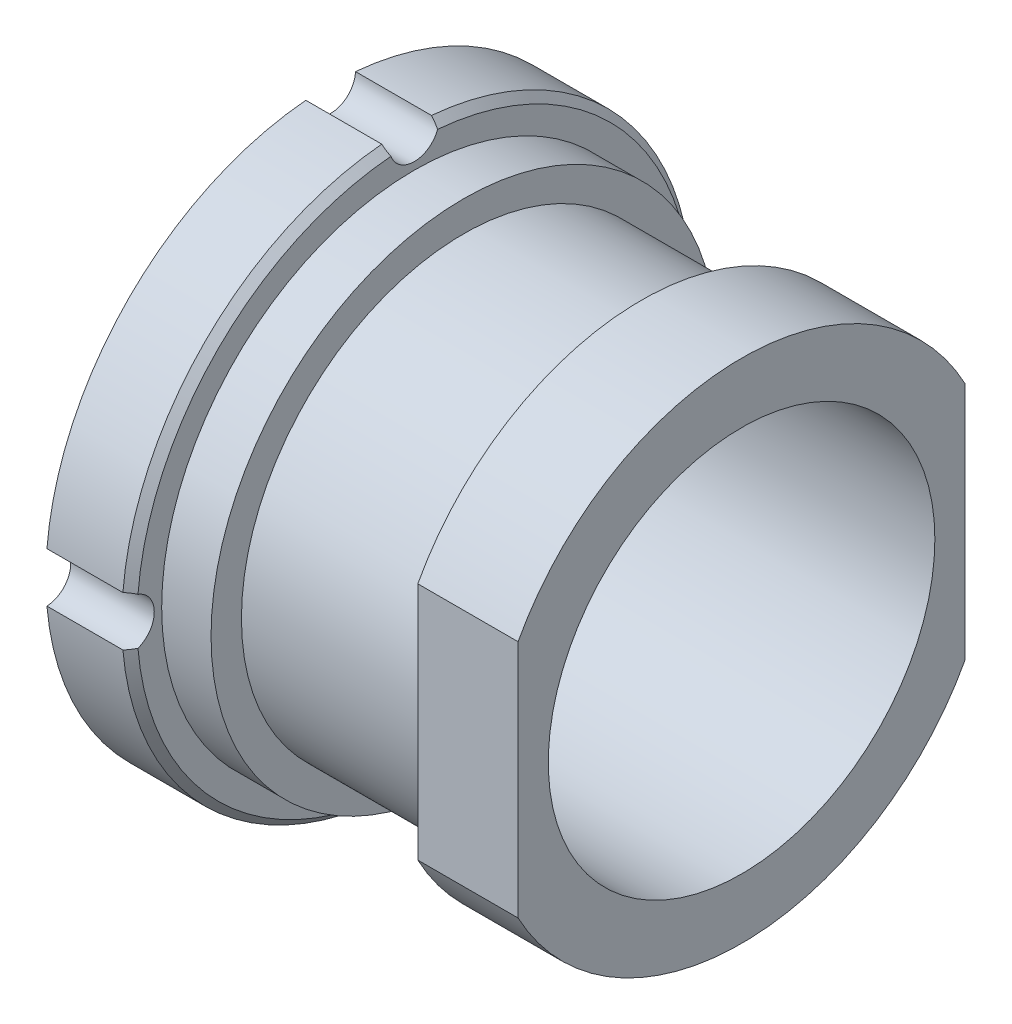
ISO-10303-21;
HEADER;
FILE_DESCRIPTION(('STEP AP214'),'2;1');
FILE_NAME('part.step','',(''),(''),'','','');
FILE_SCHEMA(('AUTOMOTIVE_DESIGN { 1 0 10303 214 1 1 1 1 }'));
ENDSEC;
DATA;
#1=APPLICATION_CONTEXT('core data for automotive mechanical design processes');
#2=APPLICATION_PROTOCOL_DEFINITION('international standard','automotive_design',2000,#1);
#3=PRODUCT_CONTEXT('',#1,'mechanical');
#4=PRODUCT('Part','Part','',(#3));
#5=PRODUCT_RELATED_PRODUCT_CATEGORY('part','',(#4));
#6=PRODUCT_DEFINITION_FORMATION('','',#4);
#7=PRODUCT_DEFINITION_CONTEXT('part definition',#1,'design');
#8=PRODUCT_DEFINITION('design','',#6,#7);
#9=PRODUCT_DEFINITION_SHAPE('','',#8);
#10=(LENGTH_UNIT() NAMED_UNIT(*) SI_UNIT(.MILLI.,.METRE.));
#11=(NAMED_UNIT(*) PLANE_ANGLE_UNIT() SI_UNIT($,.RADIAN.));
#12=(NAMED_UNIT(*) SI_UNIT($,.STERADIAN.) SOLID_ANGLE_UNIT());
#13=UNCERTAINTY_MEASURE_WITH_UNIT(LENGTH_MEASURE(1.E-05),#10,'distance_accuracy_value','');
#14=(GEOMETRIC_REPRESENTATION_CONTEXT(3) GLOBAL_UNCERTAINTY_ASSIGNED_CONTEXT((#13)) GLOBAL_UNIT_ASSIGNED_CONTEXT((#10,
#11,#12)) REPRESENTATION_CONTEXT('',''));
#15=CARTESIAN_POINT('',(0.,0.,0.));
#16=DIRECTION('',(0.,0.,1.));
#17=DIRECTION('',(1.,0.,0.));
#18=AXIS2_PLACEMENT_3D('',#15,#16,#17);
#19=CARTESIAN_POINT('',(-33.708728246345,9.525,0.));
#20=DIRECTION('',(1.,0.,0.));
#21=DIRECTION('',(0.,0.,-1.));
#22=AXIS2_PLACEMENT_3D('',#19,#20,#21);
#23=CYLINDRICAL_SURFACE('',#22,0.83185);
#24=CARTESIAN_POINT('',(-4.0767,9.525,0.));
#25=DIRECTION('',(1.,0.,0.));
#26=DIRECTION('',(0.,0.,-1.));
#27=AXIS2_PLACEMENT_3D('',#24,#25,#26);
#28=CIRCLE('',#27,0.83185);
#29=CARTESIAN_POINT('',(-4.0767,9.23806255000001,0.780795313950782));
#30=VERTEX_POINT('',#29);
#31=CARTESIAN_POINT('',(-4.0767,9.23806255,-0.780795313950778));
#32=VERTEX_POINT('',#31);
#33=EDGE_CURVE('E179',#30,#32,#28,.T.);
#34=ORIENTED_EDGE('',*,*,#33,.T.);
#35=CARTESIAN_POINT('',(-4.0767,9.23806255,-0.780795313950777));
#36=CARTESIAN_POINT('',(-4.09761991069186,9.25842428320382,-0.788275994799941));
#37=CARTESIAN_POINT('',(-4.11865624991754,9.27896888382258,-0.794924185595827));
#38=CARTESIAN_POINT('',(-4.16082740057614,9.32029488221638,-0.806554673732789));
#39=CARTESIAN_POINT('',(-4.18196172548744,9.34107538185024,-0.811541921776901));
#40=CARTESIAN_POINT('',(-4.22432074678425,9.38286712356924,-0.819894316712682));
#41=CARTESIAN_POINT('',(-4.2455454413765,9.40387836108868,-0.823259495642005));
#42=CARTESIAN_POINT('',(-4.28808615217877,9.44613347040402,-0.828376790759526));
#43=CARTESIAN_POINT('',(-4.30940225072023,9.46737785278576,-0.830124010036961));
#44=CARTESIAN_POINT('',(-4.3307,9.48867588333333,-0.83105654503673));
#45=B_SPLINE_CURVE_WITH_KNOTS('',3,(#35,#36,#37,#38,#39,#40,#41,#42,#43,#44),.UNSPECIFIED.,.F.,
.F.,(4,2,2,2,4),(0.,0.0903936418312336,0.180515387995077,0.270635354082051,0.361027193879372),.UNSPECIFIED.);
#46=CARTESIAN_POINT('',(-4.3307,9.48867588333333,-0.83105654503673));
#47=VERTEX_POINT('',#46);
#48=EDGE_CURVE('E325',#32,#47,#45,.T.);
#49=ORIENTED_EDGE('',*,*,#48,.T.);
#50=DIRECTION('',(1.,0.,0.));
#51=VECTOR('',#50,1.);
#52=CARTESIAN_POINT('',(-33.708728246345,9.48867588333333,-0.83105654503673));
#53=LINE('',#52,#51);
#54=CARTESIAN_POINT('',(-6.8707,9.48867588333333,-0.83105654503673));
#55=VERTEX_POINT('',#54);
#56=EDGE_CURVE('E165',#55,#47,#53,.T.);
#57=ORIENTED_EDGE('',*,*,#56,.F.);
#58=CARTESIAN_POINT('',(-6.8707,9.525,0.));
#59=DIRECTION('',(1.,0.,0.));
#60=DIRECTION('',(0.,0.,-1.));
#61=AXIS2_PLACEMENT_3D('',#58,#59,#60);
#62=CIRCLE('',#61,0.83185);
#63=CARTESIAN_POINT('',(-6.8707,9.48867588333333,0.83105654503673));
#64=VERTEX_POINT('',#63);
#65=EDGE_CURVE('E152',#64,#55,#62,.T.);
#66=ORIENTED_EDGE('',*,*,#65,.F.);
#67=DIRECTION('',(1.,0.,0.));
#68=VECTOR('',#67,1.);
#69=CARTESIAN_POINT('',(-33.708728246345,9.48867588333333,0.83105654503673));
#70=LINE('',#69,#68);
#71=CARTESIAN_POINT('',(-4.33069999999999,9.48867588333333,0.83105654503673));
#72=VERTEX_POINT('',#71);
#73=EDGE_CURVE('E160',#64,#72,#70,.T.);
#74=ORIENTED_EDGE('',*,*,#73,.T.);
#75=CARTESIAN_POINT('',(-4.33069999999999,9.48867588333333,0.83105654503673));
#76=CARTESIAN_POINT('',(-4.30940225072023,9.46737785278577,0.830124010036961));
#77=CARTESIAN_POINT('',(-4.28808615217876,9.44613347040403,0.828376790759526));
#78=CARTESIAN_POINT('',(-4.2455454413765,9.40387836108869,0.823259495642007));
#79=CARTESIAN_POINT('',(-4.22432074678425,9.38286712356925,0.819894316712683));
#80=CARTESIAN_POINT('',(-4.18196172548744,9.34107538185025,0.811541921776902));
#81=CARTESIAN_POINT('',(-4.16082740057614,9.32029488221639,0.806554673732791));
#82=CARTESIAN_POINT('',(-4.11865624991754,9.27896888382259,0.79492418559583));
#83=CARTESIAN_POINT('',(-4.09761991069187,9.25842428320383,0.788275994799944));
#84=CARTESIAN_POINT('',(-4.0767,9.23806255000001,0.780795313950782));
#85=B_SPLINE_CURVE_WITH_KNOTS('',3,(#75,#76,#77,#78,#79,#80,#81,#82,#83,#84),.UNSPECIFIED.,.F.,
.F.,(4,2,2,2,4),(0.,0.0903918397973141,0.18051180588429,0.27063355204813,0.361027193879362),.UNSPECIFIED.);
#86=EDGE_CURVE('E322',#72,#30,#85,.T.);
#87=ORIENTED_EDGE('',*,*,#86,.T.);
#88=EDGE_LOOP('',(#34,#49,#57,#66,#74,#87));
#89=FACE_BOUND('',#88,.T.);
#90=ADVANCED_FACE('F33',(#89),#23,.F.);
#91=CARTESIAN_POINT('',(-33.708728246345,0.,0.));
#92=DIRECTION('',(1.,0.,0.));
#93=DIRECTION('',(0.,0.,-1.));
#94=AXIS2_PLACEMENT_3D('',#91,#92,#93);
#95=CYLINDRICAL_SURFACE('',#94,9.525);
#96=DIRECTION('',(1.,0.,0.));
#97=VECTOR('',#96,1.);
#98=CARTESIAN_POINT('',(-33.708728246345,0.831056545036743,9.48867588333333));
#99=LINE('',#98,#97);
#100=CARTESIAN_POINT('',(-6.8707,0.831056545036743,9.48867588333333));
#101=VERTEX_POINT('',#100);
#102=CARTESIAN_POINT('',(-4.33069999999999,0.831056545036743,9.48867588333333));
#103=VERTEX_POINT('',#102);
#104=EDGE_CURVE('E164',#101,#103,#99,.T.);
#105=ORIENTED_EDGE('',*,*,#104,.T.);
#106=CARTESIAN_POINT('',(-4.33069999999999,0.,0.));
#107=DIRECTION('',(1.,0.,0.));
#108=DIRECTION('',(0.,0.,-1.));
#109=AXIS2_PLACEMENT_3D('',#106,#107,#108);
#110=CIRCLE('',#109,9.525);
#111=EDGE_CURVE('E11',#103,#72,#110,.F.);
#112=ORIENTED_EDGE('',*,*,#111,.T.);
#113=ORIENTED_EDGE('',*,*,#73,.F.);
#114=CARTESIAN_POINT('',(-6.8707,0.,0.));
#115=DIRECTION('',(1.,0.,0.));
#116=DIRECTION('',(0.,0.,-1.));
#117=AXIS2_PLACEMENT_3D('',#114,#115,#116);
#118=CIRCLE('',#117,9.525);
#119=EDGE_CURVE('E148',#101,#64,#118,.F.);
#120=ORIENTED_EDGE('',*,*,#119,.F.);
#121=EDGE_LOOP('',(#105,#112,#113,#120));
#122=FACE_BOUND('',#121,.T.);
#123=ADVANCED_FACE('F161',(#122),#95,.T.);
#124=CARTESIAN_POINT('',(-33.708728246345,0.,9.525));
#125=DIRECTION('',(1.,0.,0.));
#126=DIRECTION('',(0.,0.,-1.));
#127=AXIS2_PLACEMENT_3D('',#124,#125,#126);
#128=CYLINDRICAL_SURFACE('',#127,0.83185);
#129=DIRECTION('',(1.,0.,0.));
#130=VECTOR('',#129,1.);
#131=CARTESIAN_POINT('',(-33.708728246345,-0.831056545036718,9.48867588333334));
#132=LINE('',#131,#130);
#133=CARTESIAN_POINT('',(-6.8707,-0.831056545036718,9.48867588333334));
#134=VERTEX_POINT('',#133);
#135=CARTESIAN_POINT('',(-4.3307,-0.831056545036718,9.48867588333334));
#136=VERTEX_POINT('',#135);
#137=EDGE_CURVE('E201',#134,#136,#132,.T.);
#138=ORIENTED_EDGE('',*,*,#137,.T.);
#139=CARTESIAN_POINT('',(-4.3307,-0.831056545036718,9.48867588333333));
#140=CARTESIAN_POINT('',(-4.30940225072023,-0.830124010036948,9.46737785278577));
#141=CARTESIAN_POINT('',(-4.28808615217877,-0.828376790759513,9.44613347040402));
#142=CARTESIAN_POINT('',(-4.2455454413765,-0.823259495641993,9.40387836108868));
#143=CARTESIAN_POINT('',(-4.22432074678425,-0.819894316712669,9.38286712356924));
#144=CARTESIAN_POINT('',(-4.18196172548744,-0.811541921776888,9.34107538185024));
#145=CARTESIAN_POINT('',(-4.16082740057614,-0.806554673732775,9.32029488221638));
#146=CARTESIAN_POINT('',(-4.11865624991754,-0.794924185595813,9.27896888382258));
#147=CARTESIAN_POINT('',(-4.09761991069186,-0.788275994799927,9.25842428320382));
#148=CARTESIAN_POINT('',(-4.0767,-0.780795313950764,9.23806254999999));
#149=B_SPLINE_CURVE_WITH_KNOTS('',3,(#139,#140,#141,#142,#143,#144,#145,#146,#147,#148),
.UNSPECIFIED.,.F.,.F.,(4,2,2,2,4),(0.,0.0903918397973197,0.180511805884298,0.270633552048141,
0.361027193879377),.UNSPECIFIED.);
#150=CARTESIAN_POINT('',(-4.0767,-0.780795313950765,9.23806254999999));
#151=VERTEX_POINT('',#150);
#152=EDGE_CURVE('E42',#136,#151,#149,.T.);
#153=ORIENTED_EDGE('',*,*,#152,.T.);
#154=CARTESIAN_POINT('',(-4.0767,0.,9.525));
#155=DIRECTION('',(1.,0.,0.));
#156=DIRECTION('',(0.,0.,-1.));
#157=AXIS2_PLACEMENT_3D('',#154,#155,#156);
#158=CIRCLE('',#157,0.83185);
#159=CARTESIAN_POINT('',(-4.0767,0.780795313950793,9.23806255));
#160=VERTEX_POINT('',#159);
#161=EDGE_CURVE('E575',#151,#160,#158,.T.);
#162=ORIENTED_EDGE('',*,*,#161,.T.);
#163=CARTESIAN_POINT('',(-4.0767,0.780795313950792,9.23806255));
#164=CARTESIAN_POINT('',(-4.09761991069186,0.788275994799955,9.25842428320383));
#165=CARTESIAN_POINT('',(-4.11865624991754,0.794924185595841,9.27896888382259));
#166=CARTESIAN_POINT('',(-4.16082740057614,0.806554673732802,9.32029488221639));
#167=CARTESIAN_POINT('',(-4.18196172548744,0.811541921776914,9.34107538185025));
#168=CARTESIAN_POINT('',(-4.22432074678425,0.819894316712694,9.38286712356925));
#169=CARTESIAN_POINT('',(-4.2455454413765,0.823259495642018,9.40387836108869));
#170=CARTESIAN_POINT('',(-4.28808615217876,0.828376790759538,9.44613347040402));
#171=CARTESIAN_POINT('',(-4.30940225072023,0.830124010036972,9.46737785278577));
#172=CARTESIAN_POINT('',(-4.33069999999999,0.831056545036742,9.48867588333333));
#173=B_SPLINE_CURVE_WITH_KNOTS('',3,(#163,#164,#165,#166,#167,#168,#169,#170,#171,#172),
.UNSPECIFIED.,.F.,.F.,(4,2,2,2,4),(0.,0.0903936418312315,0.180515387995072,0.270635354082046,
0.361027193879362),.UNSPECIFIED.);
#174=EDGE_CURVE('E49',#160,#103,#173,.T.);
#175=ORIENTED_EDGE('',*,*,#174,.T.);
#176=ORIENTED_EDGE('',*,*,#104,.F.);
#177=CARTESIAN_POINT('',(-6.8707,0.,9.525));
#178=DIRECTION('',(1.,0.,0.));
#179=DIRECTION('',(0.,0.,-1.));
#180=AXIS2_PLACEMENT_3D('',#177,#178,#179);
#181=CIRCLE('',#180,0.83185);
#182=EDGE_CURVE('E155',#134,#101,#181,.T.);
#183=ORIENTED_EDGE('',*,*,#182,.F.);
#184=EDGE_LOOP('',(#138,#153,#162,#175,#176,#183));
#185=FACE_BOUND('',#184,.T.);
#186=ADVANCED_FACE('F302',(#185),#128,.F.);
#187=CARTESIAN_POINT('',(-33.708728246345,0.,0.));
#188=DIRECTION('',(1.,0.,0.));
#189=DIRECTION('',(0.,0.,-1.));
#190=AXIS2_PLACEMENT_3D('',#187,#188,#189);
#191=CYLINDRICAL_SURFACE('',#190,9.525);
#192=DIRECTION('',(1.,0.,0.));
#193=VECTOR('',#192,1.);
#194=CARTESIAN_POINT('',(-33.708728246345,-9.48867588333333,0.831056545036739));
#195=LINE('',#194,#193);
#196=CARTESIAN_POINT('',(-6.8707,-9.48867588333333,0.831056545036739));
#197=VERTEX_POINT('',#196);
#198=CARTESIAN_POINT('',(-4.3307,-9.48867588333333,0.831056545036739));
#199=VERTEX_POINT('',#198);
#200=EDGE_CURVE('E198',#197,#199,#195,.T.);
#201=ORIENTED_EDGE('',*,*,#200,.T.);
#202=CARTESIAN_POINT('',(-4.3307,0.,0.));
#203=DIRECTION('',(1.,0.,0.));
#204=DIRECTION('',(0.,0.,-1.));
#205=AXIS2_PLACEMENT_3D('',#202,#203,#204);
#206=CIRCLE('',#205,9.525);
#207=EDGE_CURVE('E285',#199,#136,#206,.F.);
#208=ORIENTED_EDGE('',*,*,#207,.T.);
#209=ORIENTED_EDGE('',*,*,#137,.F.);
#210=CARTESIAN_POINT('',(-6.8707,0.,0.));
#211=DIRECTION('',(1.,0.,0.));
#212=DIRECTION('',(0.,0.,-1.));
#213=AXIS2_PLACEMENT_3D('',#210,#211,#212);
#214=CIRCLE('',#213,9.525);
#215=EDGE_CURVE('E183',#197,#134,#214,.F.);
#216=ORIENTED_EDGE('',*,*,#215,.F.);
#217=EDGE_LOOP('',(#201,#208,#209,#216));
#218=FACE_BOUND('',#217,.T.);
#219=ADVANCED_FACE('F297',(#218),#191,.T.);
#220=CARTESIAN_POINT('',(-33.708728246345,-9.52499999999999,0.));
#221=DIRECTION('',(1.,0.,0.));
#222=DIRECTION('',(0.,0.,-1.));
#223=AXIS2_PLACEMENT_3D('',#220,#221,#222);
#224=CYLINDRICAL_SURFACE('',#223,0.83185);
#225=DIRECTION('',(1.,0.,0.));
#226=VECTOR('',#225,1.);
#227=CARTESIAN_POINT('',(-33.708728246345,-9.48867588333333,-0.831056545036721));
#228=LINE('',#227,#226);
#229=CARTESIAN_POINT('',(-6.8707,-9.48867588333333,-0.831056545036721));
#230=VERTEX_POINT('',#229);
#231=CARTESIAN_POINT('',(-4.3307,-9.48867588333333,-0.831056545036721));
#232=VERTEX_POINT('',#231);
#233=EDGE_CURVE('E195',#230,#232,#228,.T.);
#234=ORIENTED_EDGE('',*,*,#233,.T.);
#235=CARTESIAN_POINT('',(-4.3307,-9.48867588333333,-0.831056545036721));
#236=CARTESIAN_POINT('',(-4.30940225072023,-9.46737785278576,-0.830124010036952));
#237=CARTESIAN_POINT('',(-4.28808615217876,-9.44613347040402,-0.828376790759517));
#238=CARTESIAN_POINT('',(-4.2455454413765,-9.40387836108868,-0.823259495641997));
#239=CARTESIAN_POINT('',(-4.22432074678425,-9.38286712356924,-0.819894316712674));
#240=CARTESIAN_POINT('',(-4.18196172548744,-9.34107538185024,-0.811541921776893));
#241=CARTESIAN_POINT('',(-4.16082740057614,-9.32029488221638,-0.806554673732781));
#242=CARTESIAN_POINT('',(-4.11865624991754,-9.27896888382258,-0.79492418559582));
#243=CARTESIAN_POINT('',(-4.09761991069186,-9.25842428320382,-0.788275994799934));
#244=CARTESIAN_POINT('',(-4.0767,-9.23806254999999,-0.780795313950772));
#245=B_SPLINE_CURVE_WITH_KNOTS('',3,(#235,#236,#237,#238,#239,#240,#241,#242,#243,#244),
.UNSPECIFIED.,.F.,.F.,(4,2,2,2,4),(0.,0.0903918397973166,0.180511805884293,0.270633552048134,
0.361027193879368),.UNSPECIFIED.);
#246=CARTESIAN_POINT('',(-4.0767,-9.23806254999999,-0.780795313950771));
#247=VERTEX_POINT('',#246);
#248=EDGE_CURVE('E278',#232,#247,#245,.T.);
#249=ORIENTED_EDGE('',*,*,#248,.T.);
#250=CARTESIAN_POINT('',(-4.0767,-9.52499999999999,0.));
#251=DIRECTION('',(1.,0.,0.));
#252=DIRECTION('',(0.,0.,-1.));
#253=AXIS2_PLACEMENT_3D('',#250,#251,#252);
#254=CIRCLE('',#253,0.83185);
#255=CARTESIAN_POINT('',(-4.0767,-9.23806254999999,0.780795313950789));
#256=VERTEX_POINT('',#255);
#257=EDGE_CURVE('E573',#247,#256,#254,.T.);
#258=ORIENTED_EDGE('',*,*,#257,.T.);
#259=CARTESIAN_POINT('',(-4.0767,-9.23806254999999,0.780795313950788));
#260=CARTESIAN_POINT('',(-4.09761991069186,-9.25842428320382,0.788275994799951));
#261=CARTESIAN_POINT('',(-4.11865624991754,-9.27896888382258,0.794924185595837));
#262=CARTESIAN_POINT('',(-4.16082740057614,-9.32029488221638,0.806554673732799));
#263=CARTESIAN_POINT('',(-4.18196172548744,-9.34107538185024,0.811541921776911));
#264=CARTESIAN_POINT('',(-4.22432074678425,-9.38286712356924,0.819894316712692));
#265=CARTESIAN_POINT('',(-4.2455454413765,-9.40387836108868,0.823259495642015));
#266=CARTESIAN_POINT('',(-4.28808615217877,-9.44613347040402,0.828376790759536));
#267=CARTESIAN_POINT('',(-4.30940225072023,-9.46737785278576,0.83012401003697));
#268=CARTESIAN_POINT('',(-4.3307,-9.48867588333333,0.831056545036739));
#269=B_SPLINE_CURVE_WITH_KNOTS('',3,(#259,#260,#261,#262,#263,#264,#265,#266,#267,#268),
.UNSPECIFIED.,.F.,.F.,(4,2,2,2,4),(0.,0.0903936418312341,0.180515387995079,0.270635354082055,
0.361027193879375),.UNSPECIFIED.);
#270=EDGE_CURVE('E286',#256,#199,#269,.T.);
#271=ORIENTED_EDGE('',*,*,#270,.T.);
#272=ORIENTED_EDGE('',*,*,#200,.F.);
#273=CARTESIAN_POINT('',(-6.8707,-9.52499999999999,0.));
#274=DIRECTION('',(1.,0.,0.));
#275=DIRECTION('',(0.,0.,-1.));
#276=AXIS2_PLACEMENT_3D('',#273,#274,#275);
#277=CIRCLE('',#276,0.83185);
#278=EDGE_CURVE('E185',#230,#197,#277,.T.);
#279=ORIENTED_EDGE('',*,*,#278,.F.);
#280=EDGE_LOOP('',(#234,#249,#258,#271,#272,#279));
#281=FACE_BOUND('',#280,.T.);
#282=ADVANCED_FACE('F292',(#281),#224,.F.);
#283=CARTESIAN_POINT('',(-33.708728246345,0.,0.));
#284=DIRECTION('',(1.,0.,0.));
#285=DIRECTION('',(0.,0.,-1.));
#286=AXIS2_PLACEMENT_3D('',#283,#284,#285);
#287=CYLINDRICAL_SURFACE('',#286,9.52499999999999);
#288=DIRECTION('',(1.,0.,0.));
#289=VECTOR('',#288,1.);
#290=CARTESIAN_POINT('',(-33.708728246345,-0.831056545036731,-9.48867588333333));
#291=LINE('',#290,#289);
#292=CARTESIAN_POINT('',(-6.8707,-0.831056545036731,-9.48867588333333));
#293=VERTEX_POINT('',#292);
#294=CARTESIAN_POINT('',(-4.3307,-0.831056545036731,-9.48867588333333));
#295=VERTEX_POINT('',#294);
#296=EDGE_CURVE('E192',#293,#295,#291,.T.);
#297=ORIENTED_EDGE('',*,*,#296,.T.);
#298=CARTESIAN_POINT('',(-4.3307,0.,0.));
#299=DIRECTION('',(1.,0.,0.));
#300=DIRECTION('',(0.,0.,-1.));
#301=AXIS2_PLACEMENT_3D('',#298,#299,#300);
#302=CIRCLE('',#301,9.52499999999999);
#303=EDGE_CURVE('E328',#295,#232,#302,.F.);
#304=ORIENTED_EDGE('',*,*,#303,.T.);
#305=ORIENTED_EDGE('',*,*,#233,.F.);
#306=CARTESIAN_POINT('',(-6.8707,0.,0.));
#307=DIRECTION('',(1.,0.,0.));
#308=DIRECTION('',(0.,0.,-1.));
#309=AXIS2_PLACEMENT_3D('',#306,#307,#308);
#310=CIRCLE('',#309,9.52499999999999);
#311=EDGE_CURVE('E187',#293,#230,#310,.F.);
#312=ORIENTED_EDGE('',*,*,#311,.F.);
#313=EDGE_LOOP('',(#297,#304,#305,#312));
#314=FACE_BOUND('',#313,.T.);
#315=ADVANCED_FACE('F296',(#314),#287,.T.);
#316=CARTESIAN_POINT('',(-33.708728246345,0.,-9.52499999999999));
#317=DIRECTION('',(1.,0.,0.));
#318=DIRECTION('',(0.,0.,-1.));
#319=AXIS2_PLACEMENT_3D('',#316,#317,#318);
#320=CYLINDRICAL_SURFACE('',#319,0.83185);
#321=DIRECTION('',(1.,0.,0.));
#322=VECTOR('',#321,1.);
#323=CARTESIAN_POINT('',(-33.708728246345,0.831056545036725,-9.48867588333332));
#324=LINE('',#323,#322);
#325=CARTESIAN_POINT('',(-6.8707,0.831056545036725,-9.48867588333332));
#326=VERTEX_POINT('',#325);
#327=CARTESIAN_POINT('',(-4.33069999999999,0.831056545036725,-9.48867588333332));
#328=VERTEX_POINT('',#327);
#329=EDGE_CURVE('E157',#326,#328,#324,.T.);
#330=ORIENTED_EDGE('',*,*,#329,.T.);
#331=CARTESIAN_POINT('',(-4.3307,0.831056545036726,-9.48867588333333));
#332=CARTESIAN_POINT('',(-4.30940225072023,0.830124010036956,-9.46737785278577));
#333=CARTESIAN_POINT('',(-4.28808615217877,0.828376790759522,-9.44613347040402));
#334=CARTESIAN_POINT('',(-4.2455454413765,0.823259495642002,-9.40387836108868));
#335=CARTESIAN_POINT('',(-4.22432074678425,0.819894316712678,-9.38286712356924));
#336=CARTESIAN_POINT('',(-4.18196172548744,0.811541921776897,-9.34107538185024));
#337=CARTESIAN_POINT('',(-4.16082740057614,0.806554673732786,-9.32029488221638));
#338=CARTESIAN_POINT('',(-4.11865624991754,0.794924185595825,-9.27896888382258));
#339=CARTESIAN_POINT('',(-4.09761991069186,0.788275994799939,-9.25842428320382));
#340=CARTESIAN_POINT('',(-4.0767,0.780795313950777,-9.23806255));
#341=B_SPLINE_CURVE_WITH_KNOTS('',3,(#331,#332,#333,#334,#335,#336,#337,#338,#339,#340),
.UNSPECIFIED.,.F.,.F.,(4,2,2,2,4),(0.,0.0903918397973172,0.180511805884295,0.270633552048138,
0.361027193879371),.UNSPECIFIED.);
#342=CARTESIAN_POINT('',(-4.0767,0.780795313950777,-9.23806255));
#343=VERTEX_POINT('',#342);
#344=EDGE_CURVE('E257',#328,#343,#341,.T.);
#345=ORIENTED_EDGE('',*,*,#344,.T.);
#346=CARTESIAN_POINT('',(-4.0767,0.,-9.52499999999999));
#347=DIRECTION('',(1.,0.,0.));
#348=DIRECTION('',(0.,0.,-1.));
#349=AXIS2_PLACEMENT_3D('',#346,#347,#348);
#350=CIRCLE('',#349,0.83185);
#351=CARTESIAN_POINT('',(-4.0767,-0.780795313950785,-9.23806254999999));
#352=VERTEX_POINT('',#351);
#353=EDGE_CURVE('E568',#343,#352,#350,.T.);
#354=ORIENTED_EDGE('',*,*,#353,.T.);
#355=CARTESIAN_POINT('',(-4.0767,-0.780795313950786,-9.23806254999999));
#356=CARTESIAN_POINT('',(-4.09761991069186,-0.788275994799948,-9.25842428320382));
#357=CARTESIAN_POINT('',(-4.11865624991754,-0.794924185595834,-9.27896888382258));
#358=CARTESIAN_POINT('',(-4.16082740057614,-0.806554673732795,-9.32029488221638));
#359=CARTESIAN_POINT('',(-4.18196172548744,-0.811541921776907,-9.34107538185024));
#360=CARTESIAN_POINT('',(-4.22432074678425,-0.819894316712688,-9.38286712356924));
#361=CARTESIAN_POINT('',(-4.2455454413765,-0.823259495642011,-9.40387836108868));
#362=CARTESIAN_POINT('',(-4.28808615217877,-0.828376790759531,-9.44613347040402));
#363=CARTESIAN_POINT('',(-4.30940225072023,-0.830124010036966,-9.46737785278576));
#364=CARTESIAN_POINT('',(-4.3307,-0.831056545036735,-9.48867588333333));
#365=B_SPLINE_CURVE_WITH_KNOTS('',3,(#355,#356,#357,#358,#359,#360,#361,#362,#363,#364),
.UNSPECIFIED.,.F.,.F.,(4,2,2,2,4),(0.,0.0903936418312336,0.180515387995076,0.270635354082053,
0.361027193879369),.UNSPECIFIED.);
#366=EDGE_CURVE('E250',#352,#295,#365,.T.);
#367=ORIENTED_EDGE('',*,*,#366,.T.);
#368=ORIENTED_EDGE('',*,*,#296,.F.);
#369=CARTESIAN_POINT('',(-6.8707,0.,-9.52499999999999));
#370=DIRECTION('',(1.,0.,0.));
#371=DIRECTION('',(0.,0.,-1.));
#372=AXIS2_PLACEMENT_3D('',#369,#370,#371);
#373=CIRCLE('',#372,0.83185);
#374=EDGE_CURVE('E176',#326,#293,#373,.T.);
#375=ORIENTED_EDGE('',*,*,#374,.F.);
#376=EDGE_LOOP('',(#330,#345,#354,#367,#368,#375));
#377=FACE_BOUND('',#376,.T.);
#378=ADVANCED_FACE('F263',(#377),#320,.F.);
#379=CARTESIAN_POINT('',(-33.708728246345,0.,0.));
#380=DIRECTION('',(1.,0.,0.));
#381=DIRECTION('',(0.,0.,-1.));
#382=AXIS2_PLACEMENT_3D('',#379,#380,#381);
#383=CYLINDRICAL_SURFACE('',#382,9.525);
#384=ORIENTED_EDGE('',*,*,#56,.T.);
#385=CARTESIAN_POINT('',(-4.3307,0.,0.));
#386=DIRECTION('',(1.,0.,0.));
#387=DIRECTION('',(0.,0.,-1.));
#388=AXIS2_PLACEMENT_3D('',#385,#386,#387);
#389=CIRCLE('',#388,9.525);
#390=EDGE_CURVE('E247',#47,#328,#389,.F.);
#391=ORIENTED_EDGE('',*,*,#390,.T.);
#392=ORIENTED_EDGE('',*,*,#329,.F.);
#393=CARTESIAN_POINT('',(-6.8707,0.,0.));
#394=DIRECTION('',(1.,0.,0.));
#395=DIRECTION('',(0.,0.,-1.));
#396=AXIS2_PLACEMENT_3D('',#393,#394,#395);
#397=CIRCLE('',#396,9.525);
#398=EDGE_CURVE('E171',#55,#326,#397,.F.);
#399=ORIENTED_EDGE('',*,*,#398,.F.);
#400=EDGE_LOOP('',(#384,#391,#392,#399));
#401=FACE_BOUND('',#400,.T.);
#402=ADVANCED_FACE('F342',(#401),#383,.T.);
#403=CARTESIAN_POINT('',(-2.4257,4.7625,0.));
#404=DIRECTION('',(1.,0.,0.));
#405=DIRECTION('',(0.,0.,-1.));
#406=AXIS2_PLACEMENT_3D('',#403,#404,#405);
#407=PLANE('',#406);
#408=CARTESIAN_POINT('',(-2.4257,0.,0.));
#409=DIRECTION('',(1.,0.,0.));
#410=DIRECTION('',(0.,0.,-1.));
#411=AXIS2_PLACEMENT_3D('',#408,#409,#410);
#412=CIRCLE('',#411,7.4295);
#413=CARTESIAN_POINT('',(-2.4257,0.,-7.4295));
#414=VERTEX_POINT('',#413);
#415=EDGE_CURVE('E244',#414,#414,#412,.F.);
#416=ORIENTED_EDGE('',*,*,#415,.T.);
#417=EDGE_LOOP('',(#416));
#418=FACE_BOUND('',#417,.T.);
#419=CARTESIAN_POINT('',(-2.4257,0.,0.));
#420=DIRECTION('',(1.,0.,0.));
#421=DIRECTION('',(0.,0.,-1.));
#422=AXIS2_PLACEMENT_3D('',#419,#420,#421);
#423=CIRCLE('',#422,8.4455);
#424=CARTESIAN_POINT('',(-2.4257,0.,-8.4455));
#425=VERTEX_POINT('',#424);
#426=EDGE_CURVE('E563',#425,#425,#423,.T.);
#427=ORIENTED_EDGE('',*,*,#426,.T.);
#428=EDGE_LOOP('',(#427));
#429=FACE_BOUND('',#428,.T.);
#430=ADVANCED_FACE('F346',(#418,#429),#407,.T.);
#431=CARTESIAN_POINT('',(-6.8707,0.,0.));
#432=DIRECTION('',(1.,0.,0.));
#433=DIRECTION('',(0.,0.,-1.));
#434=AXIS2_PLACEMENT_3D('',#431,#432,#433);
#435=PLANE('',#434);
#436=CARTESIAN_POINT('',(-6.8707,0.,0.));
#437=DIRECTION('',(1.,0.,0.));
#438=DIRECTION('',(0.,0.,-1.));
#439=AXIS2_PLACEMENT_3D('',#436,#437,#438);
#440=CIRCLE('',#439,6.4643);
#441=CARTESIAN_POINT('',(-6.8707,0.,-6.4643));
#442=VERTEX_POINT('',#441);
#443=EDGE_CURVE('E214',#442,#442,#440,.T.);
#444=ORIENTED_EDGE('',*,*,#443,.T.);
#445=EDGE_LOOP('',(#444));
#446=FACE_BOUND('',#445,.T.);
#447=ORIENTED_EDGE('',*,*,#398,.T.);
#448=ORIENTED_EDGE('',*,*,#374,.T.);
#449=ORIENTED_EDGE('',*,*,#311,.T.);
#450=ORIENTED_EDGE('',*,*,#278,.T.);
#451=ORIENTED_EDGE('',*,*,#215,.T.);
#452=ORIENTED_EDGE('',*,*,#182,.T.);
#453=ORIENTED_EDGE('',*,*,#119,.T.);
#454=ORIENTED_EDGE('',*,*,#65,.T.);
#455=EDGE_LOOP('',(#447,#448,#449,#450,#451,#452,#453,#454));
#456=FACE_BOUND('',#455,.T.);
#457=ADVANCED_FACE('F150',(#446,#456),#435,.F.);
#458=CARTESIAN_POINT('',(6.8707,0.,0.));
#459=DIRECTION('',(1.,0.,0.));
#460=DIRECTION('',(0.,0.,-1.));
#461=AXIS2_PLACEMENT_3D('',#458,#459,#460);
#462=PLANE('',#461);
#463=CARTESIAN_POINT('',(6.8707,0.,0.));
#464=DIRECTION('',(1.,0.,0.));
#465=DIRECTION('',(0.,0.,-1.));
#466=AXIS2_PLACEMENT_3D('',#463,#464,#465);
#467=CIRCLE('',#466,8.47725);
#468=CARTESIAN_POINT('',(6.8707,4.00047984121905,-7.47395));
#469=VERTEX_POINT('',#468);
#470=CARTESIAN_POINT('',(6.8707,4.00047984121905,7.47395));
#471=VERTEX_POINT('',#470);
#472=EDGE_CURVE('E218',#469,#471,#467,.T.);
#473=ORIENTED_EDGE('',*,*,#472,.T.);
#474=DIRECTION('',(0.,-1.,0.));
#475=VECTOR('',#474,1.);
#476=CARTESIAN_POINT('',(6.8707,4.00047984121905,7.47395));
#477=LINE('',#476,#475);
#478=CARTESIAN_POINT('',(6.8707,-4.00047984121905,7.47395));
#479=VERTEX_POINT('',#478);
#480=EDGE_CURVE('E223',#471,#479,#477,.T.);
#481=ORIENTED_EDGE('',*,*,#480,.T.);
#482=CARTESIAN_POINT('',(6.8707,0.,0.));
#483=DIRECTION('',(1.,0.,0.));
#484=DIRECTION('',(0.,0.,-1.));
#485=AXIS2_PLACEMENT_3D('',#482,#483,#484);
#486=CIRCLE('',#485,8.47725);
#487=CARTESIAN_POINT('',(6.8707,-4.00047984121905,-7.47395));
#488=VERTEX_POINT('',#487);
#489=EDGE_CURVE('E225',#479,#488,#486,.T.);
#490=ORIENTED_EDGE('',*,*,#489,.T.);
#491=DIRECTION('',(0.,1.,0.));
#492=VECTOR('',#491,1.);
#493=CARTESIAN_POINT('',(6.8707,4.00047984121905,-7.47395));
#494=LINE('',#493,#492);
#495=EDGE_CURVE('E227',#488,#469,#494,.T.);
#496=ORIENTED_EDGE('',*,*,#495,.T.);
#497=EDGE_LOOP('',(#473,#481,#490,#496));
#498=FACE_BOUND('',#497,.T.);
#499=CARTESIAN_POINT('',(6.8707,0.,0.));
#500=DIRECTION('',(1.,0.,0.));
#501=DIRECTION('',(0.,0.,-1.));
#502=AXIS2_PLACEMENT_3D('',#499,#500,#501);
#503=CIRCLE('',#502,6.4643);
#504=CARTESIAN_POINT('',(6.8707,0.,-6.4643));
#505=VERTEX_POINT('',#504);
#506=EDGE_CURVE('E215',#505,#505,#503,.T.);
#507=ORIENTED_EDGE('',*,*,#506,.F.);
#508=EDGE_LOOP('',(#507));
#509=FACE_BOUND('',#508,.T.);
#510=ADVANCED_FACE('F362',(#498,#509),#462,.T.);
#511=CARTESIAN_POINT('',(6.8707,0.,0.));
#512=DIRECTION('',(-1.,0.,0.));
#513=DIRECTION('',(0.,0.,1.));
#514=AXIS2_PLACEMENT_3D('',#511,#512,#513);
#515=CYLINDRICAL_SURFACE('',#514,8.47725);
#516=DIRECTION('',(-1.,0.,0.));
#517=VECTOR('',#516,1.);
#518=CARTESIAN_POINT('',(6.8707,4.00047984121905,-7.47395));
#519=LINE('',#518,#517);
#520=CARTESIAN_POINT('',(3.5179,4.00047984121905,-7.47395));
#521=VERTEX_POINT('',#520);
#522=EDGE_CURVE('E229',#469,#521,#519,.T.);
#523=ORIENTED_EDGE('',*,*,#522,.T.);
#524=CARTESIAN_POINT('',(3.5179,0.,0.));
#525=DIRECTION('',(1.,0.,0.));
#526=DIRECTION('',(0.,0.,-1.));
#527=AXIS2_PLACEMENT_3D('',#524,#525,#526);
#528=CIRCLE('',#527,8.47725);
#529=CARTESIAN_POINT('',(3.5179,4.00047984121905,7.47395));
#530=VERTEX_POINT('',#529);
#531=EDGE_CURVE('E211',#521,#530,#528,.T.);
#532=ORIENTED_EDGE('',*,*,#531,.T.);
#533=DIRECTION('',(-1.,0.,0.));
#534=VECTOR('',#533,1.);
#535=CARTESIAN_POINT('',(6.8707,4.00047984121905,7.47395));
#536=LINE('',#535,#534);
#537=EDGE_CURVE('E238',#471,#530,#536,.T.);
#538=ORIENTED_EDGE('',*,*,#537,.F.);
#539=ORIENTED_EDGE('',*,*,#472,.F.);
#540=EDGE_LOOP('',(#523,#532,#538,#539));
#541=FACE_BOUND('',#540,.T.);
#542=ADVANCED_FACE('F365',(#541),#515,.T.);
#543=CARTESIAN_POINT('',(6.8707,4.00047984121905,7.47395));
#544=DIRECTION('',(0.,0.,-1.));
#545=DIRECTION('',(-1.,0.,0.));
#546=AXIS2_PLACEMENT_3D('',#543,#544,#545);
#547=PLANE('',#546);
#548=ORIENTED_EDGE('',*,*,#537,.T.);
#549=DIRECTION('',(0.,-1.,0.));
#550=VECTOR('',#549,1.);
#551=CARTESIAN_POINT('',(3.5179,4.00047984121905,7.47395));
#552=LINE('',#551,#550);
#553=CARTESIAN_POINT('',(3.5179,-4.00047984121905,7.47395));
#554=VERTEX_POINT('',#553);
#555=EDGE_CURVE('E208',#530,#554,#552,.T.);
#556=ORIENTED_EDGE('',*,*,#555,.T.);
#557=DIRECTION('',(-1.,0.,0.));
#558=VECTOR('',#557,1.);
#559=CARTESIAN_POINT('',(6.8707,-4.00047984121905,7.47395));
#560=LINE('',#559,#558);
#561=EDGE_CURVE('E235',#479,#554,#560,.T.);
#562=ORIENTED_EDGE('',*,*,#561,.F.);
#563=ORIENTED_EDGE('',*,*,#480,.F.);
#564=EDGE_LOOP('',(#548,#556,#562,#563));
#565=FACE_BOUND('',#564,.T.);
#566=ADVANCED_FACE('F376',(#565),#547,.F.);
#567=CARTESIAN_POINT('',(6.8707,0.,0.));
#568=DIRECTION('',(-1.,0.,0.));
#569=DIRECTION('',(0.,0.,1.));
#570=AXIS2_PLACEMENT_3D('',#567,#568,#569);
#571=CYLINDRICAL_SURFACE('',#570,8.47725);
#572=ORIENTED_EDGE('',*,*,#561,.T.);
#573=CARTESIAN_POINT('',(3.5179,0.,0.));
#574=DIRECTION('',(1.,0.,0.));
#575=DIRECTION('',(0.,0.,-1.));
#576=AXIS2_PLACEMENT_3D('',#573,#574,#575);
#577=CIRCLE('',#576,8.47725);
#578=CARTESIAN_POINT('',(3.5179,-4.00047984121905,-7.47395));
#579=VERTEX_POINT('',#578);
#580=EDGE_CURVE('E174',#554,#579,#577,.T.);
#581=ORIENTED_EDGE('',*,*,#580,.T.);
#582=DIRECTION('',(-1.,0.,0.));
#583=VECTOR('',#582,1.);
#584=CARTESIAN_POINT('',(6.8707,-4.00047984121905,-7.47395));
#585=LINE('',#584,#583);
#586=EDGE_CURVE('E232',#488,#579,#585,.T.);
#587=ORIENTED_EDGE('',*,*,#586,.F.);
#588=ORIENTED_EDGE('',*,*,#489,.F.);
#589=EDGE_LOOP('',(#572,#581,#587,#588));
#590=FACE_BOUND('',#589,.T.);
#591=ADVANCED_FACE('F372',(#590),#571,.T.);
#592=CARTESIAN_POINT('',(6.8707,4.00047984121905,-7.47395));
#593=DIRECTION('',(0.,0.,1.));
#594=DIRECTION('',(0.,-1.,0.));
#595=AXIS2_PLACEMENT_3D('',#592,#593,#594);
#596=PLANE('',#595);
#597=ORIENTED_EDGE('',*,*,#586,.T.);
#598=DIRECTION('',(0.,1.,0.));
#599=VECTOR('',#598,1.);
#600=CARTESIAN_POINT('',(3.5179,4.00047984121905,-7.47395));
#601=LINE('',#600,#599);
#602=EDGE_CURVE('E241',#579,#521,#601,.T.);
#603=ORIENTED_EDGE('',*,*,#602,.T.);
#604=ORIENTED_EDGE('',*,*,#522,.F.);
#605=ORIENTED_EDGE('',*,*,#495,.F.);
#606=EDGE_LOOP('',(#597,#603,#604,#605));
#607=FACE_BOUND('',#606,.T.);
#608=ADVANCED_FACE('F360',(#607),#596,.F.);
#609=CARTESIAN_POINT('',(6.8707,0.,0.));
#610=DIRECTION('',(-1.,0.,0.));
#611=DIRECTION('',(0.,0.,1.));
#612=AXIS2_PLACEMENT_3D('',#609,#610,#611);
#613=CYLINDRICAL_SURFACE('',#612,6.4643);
#614=ORIENTED_EDGE('',*,*,#506,.T.);
#615=EDGE_LOOP('',(#614));
#616=FACE_BOUND('',#615,.T.);
#617=ORIENTED_EDGE('',*,*,#443,.F.);
#618=EDGE_LOOP('',(#617));
#619=FACE_BOUND('',#618,.T.);
#620=ADVANCED_FACE('F352',(#616,#619),#613,.F.);
#621=CARTESIAN_POINT('',(-10.2235,0.,0.));
#622=DIRECTION('',(1.,0.,0.));
#623=DIRECTION('',(0.,0.,-1.));
#624=AXIS2_PLACEMENT_3D('',#621,#622,#623);
#625=CYLINDRICAL_SURFACE('',#624,7.4295);
#626=ORIENTED_EDGE('',*,*,#415,.F.);
#627=EDGE_LOOP('',(#626));
#628=FACE_BOUND('',#627,.T.);
#629=CARTESIAN_POINT('',(3.5179,0.,0.));
#630=DIRECTION('',(1.,0.,0.));
#631=DIRECTION('',(0.,0.,-1.));
#632=AXIS2_PLACEMENT_3D('',#629,#630,#631);
#633=CIRCLE('',#632,7.4295);
#634=CARTESIAN_POINT('',(3.5179,0.,-7.4295));
#635=VERTEX_POINT('',#634);
#636=EDGE_CURVE('E170',#635,#635,#633,.T.);
#637=ORIENTED_EDGE('',*,*,#636,.F.);
#638=EDGE_LOOP('',(#637));
#639=FACE_BOUND('',#638,.T.);
#640=ADVANCED_FACE('F348',(#628,#639),#625,.T.);
#641=CARTESIAN_POINT('',(3.5179,0.,0.));
#642=DIRECTION('',(1.,0.,0.));
#643=DIRECTION('',(0.,0.,-1.));
#644=AXIS2_PLACEMENT_3D('',#641,#642,#643);
#645=PLANE('',#644);
#646=ORIENTED_EDGE('',*,*,#636,.T.);
#647=EDGE_LOOP('',(#646));
#648=FACE_BOUND('',#647,.T.);
#649=ORIENTED_EDGE('',*,*,#602,.F.);
#650=ORIENTED_EDGE('',*,*,#580,.F.);
#651=ORIENTED_EDGE('',*,*,#555,.F.);
#652=ORIENTED_EDGE('',*,*,#531,.F.);
#653=EDGE_LOOP('',(#649,#650,#651,#652));
#654=FACE_BOUND('',#653,.T.);
#655=ADVANCED_FACE('F351',(#648,#654),#645,.F.);
#656=CARTESIAN_POINT('',(-4.0767,0.,0.));
#657=DIRECTION('',(1.,0.,0.));
#658=DIRECTION('',(0.,0.,-1.));
#659=AXIS2_PLACEMENT_3D('',#656,#657,#658);
#660=PLANE('',#659);
#661=ORIENTED_EDGE('',*,*,#353,.F.);
#662=CARTESIAN_POINT('',(-4.0767,0.,0.));
#663=DIRECTION('',(1.,0.,0.));
#664=DIRECTION('',(0.,0.,-1.));
#665=AXIS2_PLACEMENT_3D('',#662,#663,#664);
#666=CIRCLE('',#665,9.27099999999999);
#667=EDGE_CURVE('E326',#343,#32,#666,.T.);
#668=ORIENTED_EDGE('',*,*,#667,.T.);
#669=ORIENTED_EDGE('',*,*,#33,.F.);
#670=CARTESIAN_POINT('',(-4.0767,0.,0.));
#671=DIRECTION('',(1.,0.,0.));
#672=DIRECTION('',(0.,0.,-1.));
#673=AXIS2_PLACEMENT_3D('',#670,#671,#672);
#674=CIRCLE('',#673,9.271);
#675=EDGE_CURVE('E323',#30,#160,#674,.T.);
#676=ORIENTED_EDGE('',*,*,#675,.T.);
#677=ORIENTED_EDGE('',*,*,#161,.F.);
#678=CARTESIAN_POINT('',(-4.0767,0.,0.));
#679=DIRECTION('',(1.,0.,0.));
#680=DIRECTION('',(0.,0.,-1.));
#681=AXIS2_PLACEMENT_3D('',#678,#679,#680);
#682=CIRCLE('',#681,9.27099999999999);
#683=EDGE_CURVE('E589',#151,#256,#682,.T.);
#684=ORIENTED_EDGE('',*,*,#683,.T.);
#685=ORIENTED_EDGE('',*,*,#257,.F.);
#686=CARTESIAN_POINT('',(-4.0767,0.,0.));
#687=DIRECTION('',(1.,0.,0.));
#688=DIRECTION('',(0.,0.,-1.));
#689=AXIS2_PLACEMENT_3D('',#686,#687,#688);
#690=CIRCLE('',#689,9.27099999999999);
#691=EDGE_CURVE('E330',#247,#352,#690,.T.);
#692=ORIENTED_EDGE('',*,*,#691,.T.);
#693=EDGE_LOOP('',(#661,#668,#669,#676,#677,#684,#685,#692));
#694=FACE_BOUND('',#693,.T.);
#695=CARTESIAN_POINT('',(-4.0767,0.,0.));
#696=DIRECTION('',(1.,0.,0.));
#697=DIRECTION('',(0.,0.,-1.));
#698=AXIS2_PLACEMENT_3D('',#695,#696,#697);
#699=CIRCLE('',#698,8.4455);
#700=CARTESIAN_POINT('',(-4.0767,0.,-8.4455));
#701=VERTEX_POINT('',#700);
#702=EDGE_CURVE('E565',#701,#701,#699,.T.);
#703=ORIENTED_EDGE('',*,*,#702,.F.);
#704=EDGE_LOOP('',(#703));
#705=FACE_BOUND('',#704,.T.);
#706=ADVANCED_FACE('F356',(#694,#705),#660,.T.);
#707=CARTESIAN_POINT('',(-4.0767,0.,0.));
#708=DIRECTION('',(1.,0.,0.));
#709=DIRECTION('',(0.,0.,-1.));
#710=AXIS2_PLACEMENT_3D('',#707,#708,#709);
#711=CYLINDRICAL_SURFACE('',#710,8.4455);
#712=CARTESIAN_POINT('',(-4.0767,0.,-8.4455));
#713=CARTESIAN_POINT('',(-4.05950208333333,0.,-8.4455));
#714=CARTESIAN_POINT('',(-4.04230416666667,0.,-8.4455));
#715=CARTESIAN_POINT('',(-4.00790833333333,0.,-8.4455));
#716=CARTESIAN_POINT('',(-3.99071041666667,0.,-8.4455));
#717=CARTESIAN_POINT('',(-3.95631458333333,0.,-8.4455));
#718=CARTESIAN_POINT('',(-3.93911666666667,0.,-8.4455));
#719=CARTESIAN_POINT('',(-3.90472083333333,0.,-8.4455));
#720=CARTESIAN_POINT('',(-3.88752291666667,0.,-8.4455));
#721=CARTESIAN_POINT('',(-3.85312708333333,0.,-8.4455));
#722=CARTESIAN_POINT('',(-3.83592916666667,0.,-8.4455));
#723=CARTESIAN_POINT('',(-3.80153333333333,0.,-8.4455));
#724=CARTESIAN_POINT('',(-3.78433541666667,0.,-8.4455));
#725=CARTESIAN_POINT('',(-3.74993958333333,0.,-8.4455));
#726=CARTESIAN_POINT('',(-3.73274166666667,0.,-8.4455));
#727=CARTESIAN_POINT('',(-3.69834583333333,0.,-8.4455));
#728=CARTESIAN_POINT('',(-3.68114791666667,0.,-8.4455));
#729=CARTESIAN_POINT('',(-3.64675208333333,0.,-8.4455));
#730=CARTESIAN_POINT('',(-3.62955416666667,0.,-8.4455));
#731=CARTESIAN_POINT('',(-3.59515833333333,0.,-8.4455));
#732=CARTESIAN_POINT('',(-3.57796041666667,0.,-8.4455));
#733=CARTESIAN_POINT('',(-3.54356458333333,0.,-8.4455));
#734=CARTESIAN_POINT('',(-3.52636666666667,0.,-8.4455));
#735=CARTESIAN_POINT('',(-3.49197083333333,0.,-8.4455));
#736=CARTESIAN_POINT('',(-3.47477291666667,0.,-8.4455));
#737=CARTESIAN_POINT('',(-3.44037708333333,0.,-8.4455));
#738=CARTESIAN_POINT('',(-3.42317916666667,0.,-8.4455));
#739=CARTESIAN_POINT('',(-3.38878333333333,0.,-8.4455));
#740=CARTESIAN_POINT('',(-3.37158541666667,0.,-8.4455));
#741=CARTESIAN_POINT('',(-3.33718958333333,0.,-8.4455));
#742=CARTESIAN_POINT('',(-3.31999166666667,0.,-8.4455));
#743=CARTESIAN_POINT('',(-3.28559583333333,0.,-8.4455));
#744=CARTESIAN_POINT('',(-3.26839791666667,0.,-8.4455));
#745=CARTESIAN_POINT('',(-3.23400208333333,0.,-8.4455));
#746=CARTESIAN_POINT('',(-3.21680416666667,0.,-8.4455));
#747=CARTESIAN_POINT('',(-3.18240833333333,0.,-8.4455));
#748=CARTESIAN_POINT('',(-3.16521041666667,0.,-8.4455));
#749=CARTESIAN_POINT('',(-3.13081458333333,0.,-8.4455));
#750=CARTESIAN_POINT('',(-3.11361666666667,0.,-8.4455));
#751=CARTESIAN_POINT('',(-3.07922083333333,0.,-8.4455));
#752=CARTESIAN_POINT('',(-3.06202291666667,0.,-8.4455));
#753=CARTESIAN_POINT('',(-3.02762708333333,0.,-8.4455));
#754=CARTESIAN_POINT('',(-3.01042916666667,0.,-8.4455));
#755=CARTESIAN_POINT('',(-2.97603333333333,0.,-8.4455));
#756=CARTESIAN_POINT('',(-2.95883541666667,0.,-8.4455));
#757=CARTESIAN_POINT('',(-2.92443958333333,0.,-8.4455));
#758=CARTESIAN_POINT('',(-2.90724166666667,0.,-8.4455));
#759=CARTESIAN_POINT('',(-2.87284583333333,0.,-8.4455));
#760=CARTESIAN_POINT('',(-2.85564791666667,0.,-8.4455));
#761=CARTESIAN_POINT('',(-2.82125208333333,0.,-8.4455));
#762=CARTESIAN_POINT('',(-2.80405416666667,0.,-8.4455));
#763=CARTESIAN_POINT('',(-2.76965833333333,0.,-8.4455));
#764=CARTESIAN_POINT('',(-2.75246041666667,0.,-8.4455));
#765=CARTESIAN_POINT('',(-2.71806458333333,0.,-8.4455));
#766=CARTESIAN_POINT('',(-2.70086666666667,0.,-8.4455));
#767=CARTESIAN_POINT('',(-2.66647083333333,0.,-8.4455));
#768=CARTESIAN_POINT('',(-2.64927291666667,0.,-8.4455));
#769=CARTESIAN_POINT('',(-2.61487708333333,0.,-8.4455));
#770=CARTESIAN_POINT('',(-2.59767916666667,0.,-8.4455));
#771=CARTESIAN_POINT('',(-2.56328333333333,0.,-8.4455));
#772=CARTESIAN_POINT('',(-2.54608541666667,0.,-8.4455));
#773=CARTESIAN_POINT('',(-2.51168958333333,0.,-8.4455));
#774=CARTESIAN_POINT('',(-2.49449166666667,0.,-8.4455));
#775=CARTESIAN_POINT('',(-2.46009583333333,0.,-8.4455));
#776=CARTESIAN_POINT('',(-2.44289791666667,0.,-8.4455));
#777=CARTESIAN_POINT('',(-2.4257,0.,-8.4455));
#778=B_SPLINE_CURVE_WITH_KNOTS('',3,(#712,#713,#714,#715,#716,#717,#718,#719,#720,#721,#722,
#723,#724,#725,#726,#727,#728,#729,#730,#731,#732,#733,#734,#735,#736,#737,#738,#739,#740,#741,
#742,#743,#744,#745,#746,#747,#748,#749,#750,#751,#752,#753,#754,#755,#756,#757,#758,#759,#760,
#761,#762,#763,#764,#765,#766,#767,#768,#769,#770,#771,#772,#773,#774,#775,#776,#777),
.UNSPECIFIED.,.F.,.F.,(4,2,2,2,2,2,2,2,2,2,2,2,2,2,2,2,2,2,2,2,2,2,2,2,2,2,2,2,2,2,2,2,4),(0.,
0.0515937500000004,0.103187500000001,0.15478125,0.206375,0.25796875,0.3095625,0.36115625,
0.41275,0.46434375,0.5159375,0.56753125,0.619125,0.67071875,0.7223125,0.77390625,0.8255,
0.87709375,0.9286875,0.98028125,1.031875,1.08346875,1.1350625,1.18665625,1.23825,1.28984375,
1.3414375,1.39303125,1.444625,1.49621875,1.5478125,1.59940625,1.651),.UNSPECIFIED.);
#779=EDGE_CURVE('BSEAM430',#701,#425,#778,.T.);
#780=ORIENTED_EDGE('',*,*,#702,.T.);
#781=ORIENTED_EDGE('',*,*,#426,.F.);
#782=ORIENTED_EDGE('',*,*,#779,.T.);
#783=ORIENTED_EDGE('',*,*,#779,.F.);
#784=EDGE_LOOP('',(#780,#782,#781,#783));
#785=FACE_BOUND('',#784,.T.);
#786=ADVANCED_FACE('F430',(#785),#711,.T.);
#787=CARTESIAN_POINT('',(-4.3307,0.,0.));
#788=DIRECTION('',(-1.,0.,0.));
#789=DIRECTION('',(0.,0.,1.));
#790=AXIS2_PLACEMENT_3D('',#787,#788,#789);
#791=CONICAL_SURFACE('',#790,9.525,0.785398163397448);
#792=ORIENTED_EDGE('',*,*,#48,.F.);
#793=ORIENTED_EDGE('',*,*,#667,.F.);
#794=ORIENTED_EDGE('',*,*,#344,.F.);
#795=ORIENTED_EDGE('',*,*,#390,.F.);
#796=EDGE_LOOP('',(#792,#793,#794,#795));
#797=FACE_BOUND('',#796,.T.);
#798=ADVANCED_FACE('F271',(#797),#791,.T.);
#799=CARTESIAN_POINT('',(-4.3307,0.,0.));
#800=DIRECTION('',(-1.,0.,0.));
#801=DIRECTION('',(0.,0.,1.));
#802=AXIS2_PLACEMENT_3D('',#799,#800,#801);
#803=CONICAL_SURFACE('',#802,9.52499999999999,0.785398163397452);
#804=ORIENTED_EDGE('',*,*,#366,.F.);
#805=ORIENTED_EDGE('',*,*,#691,.F.);
#806=ORIENTED_EDGE('',*,*,#248,.F.);
#807=ORIENTED_EDGE('',*,*,#303,.F.);
#808=EDGE_LOOP('',(#804,#805,#806,#807));
#809=FACE_BOUND('',#808,.T.);
#810=ADVANCED_FACE('F267',(#809),#803,.T.);
#811=CARTESIAN_POINT('',(-4.3307,0.,0.));
#812=DIRECTION('',(-1.,0.,0.));
#813=DIRECTION('',(0.,0.,1.));
#814=AXIS2_PLACEMENT_3D('',#811,#812,#813);
#815=CONICAL_SURFACE('',#814,9.525,0.785398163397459);
#816=ORIENTED_EDGE('',*,*,#270,.F.);
#817=ORIENTED_EDGE('',*,*,#683,.F.);
#818=ORIENTED_EDGE('',*,*,#152,.F.);
#819=ORIENTED_EDGE('',*,*,#207,.F.);
#820=EDGE_LOOP('',(#816,#817,#818,#819));
#821=FACE_BOUND('',#820,.T.);
#822=ADVANCED_FACE('F270',(#821),#815,.T.);
#823=CARTESIAN_POINT('',(-4.33069999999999,0.,0.));
#824=DIRECTION('',(-1.,0.,0.));
#825=DIRECTION('',(0.,0.,1.));
#826=AXIS2_PLACEMENT_3D('',#823,#824,#825);
#827=CONICAL_SURFACE('',#826,9.525,0.785398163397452);
#828=ORIENTED_EDGE('',*,*,#174,.F.);
#829=ORIENTED_EDGE('',*,*,#675,.F.);
#830=ORIENTED_EDGE('',*,*,#86,.F.);
#831=ORIENTED_EDGE('',*,*,#111,.F.);
#832=EDGE_LOOP('',(#828,#829,#830,#831));
#833=FACE_BOUND('',#832,.T.);
#834=ADVANCED_FACE('F35',(#833),#827,.T.);
#835=CLOSED_SHELL('',(#90,#123,#186,#219,#282,#315,#378,#402,#430,#457,#510,#542,#566,#591,#608,
#620,#640,#655,#706,#786,#798,#810,#822,#834));
#836=MANIFOLD_SOLID_BREP('B2',#835);
#837=ADVANCED_BREP_SHAPE_REPRESENTATION('',(#18,#836),#14);
#838=SHAPE_DEFINITION_REPRESENTATION(#9,#837);
ENDSEC;
END-ISO-10303-21;
